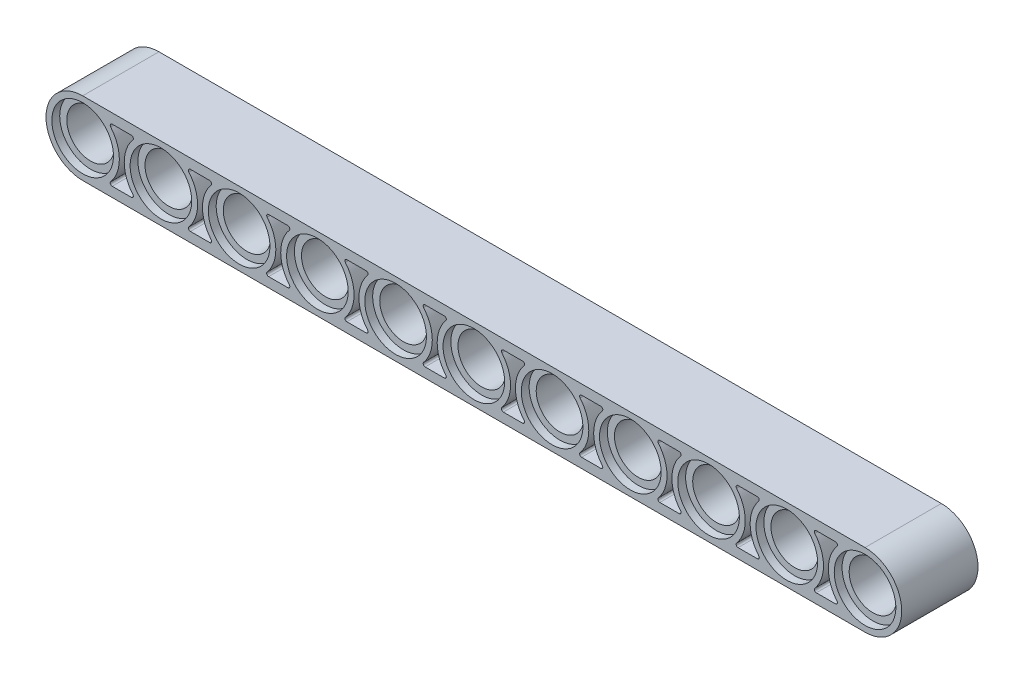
from build123d import *

# Parameters (mm, degrees)
BODY_DEPTH                   = 3.9
CUT_OUT_DEPTH                = 3.4
HOLE_PATTERN_COUNT           = 11
HOLE_PATTERN_PITCH           = 8
CUT_OUT_PATTERN_COUNT        = 10
CUT_OUT_PATTERN_PITCH        = 8
CUT_OUT_PATTERN_COPY_1_DEPTH = 3.4
CUT_OUT_PATTERN_COPY_2_DEPTH = 3.4
CUT_OUT_PATTERN_COPY_3_DEPTH = 3.4
CUT_OUT_PATTERN_COPY_4_DEPTH = 3.4
CUT_OUT_PATTERN_COPY_5_DEPTH = 3.4
CUT_OUT_PATTERN_COPY_6_DEPTH = 3.4
CUT_OUT_PATTERN_COPY_7_DEPTH = 3.4
CUT_OUT_PATTERN_COPY_8_DEPTH = 3.4
CUT_OUT_PATTERN_COPY_9_DEPTH = 3.4


with BuildPart() as part:
    # Sketch1 → Body (new, symmetric)
    with BuildSketch(Plane.XY):
        with BuildLine():
            Line((0, 3.75), (80, 3.75))
            ThreePointArc((80, 3.75), (83.75, 0), (80, -3.75))
            Line((80, -3.75), (0, -3.75))
            ThreePointArc((0, -3.75), (-3.75, 0), (0, 3.75))
        make_face()
    extrude(amount=BODY_DEPTH, both=True)

    # Sketch2 → Hole (revolve, cut)
    with BuildSketch(Plane(origin=(0, 0, 0), x_dir=(1, 0, 0), z_dir=(0, 1, 0)), mode=Mode.PRIVATE) as hole_sk:
        Polygon((0, -3.9), (0, 3.9), (3.15, 3.9), (3.15, 3.1), (2.425, 3.1), (2.425, -3.1), (3.15, -3.1), (3.15, -3.9), align=None)
    hole = revolve(hole_sk.sketch.rotate(Axis((0, 0, -4.29), (0, 0, 1)), 180), axis=Axis((0, 0, -4.29), (0, 0, 1)), mode=Mode.SUBTRACT)

    # Sketch3 → Cut Out (cut)
    with BuildSketch(Plane.XY.offset(3.9)):
        with BuildLine():
            Line((3.016620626, 2.75), (4.983379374, 2.75))
            ThreePointArc((4.983379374, 2.75), (5.164794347, 2.634193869), (5.136119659, 2.420886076))
            ThreePointArc((5.136119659, 2.420886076), (4.25, 0), (5.136119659, -2.420886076))
            ThreePointArc((5.136119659, -2.420886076), (5.164794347, -2.634193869), (4.983379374, -2.75))
            Line((4.983379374, -2.75), (3.016620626, -2.75))
            ThreePointArc((3.016620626, -2.75), (2.835205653, -2.634193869), (2.863880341, -2.420886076))
            ThreePointArc((2.863880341, -2.420886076), (3.75, 0), (2.863880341, 2.420886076))
            ThreePointArc((2.863880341, 2.420886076), (2.835205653, 2.634193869), (3.016620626, 2.75))
        make_face()
    cut_out = extrude(amount=-CUT_OUT_DEPTH, mode=Mode.SUBTRACT)

    # Mirror1: Cut Out across plane
    add(cut_out.mirror(Plane.XY), mode=Mode.SUBTRACT)

    # HOLE Pattern: Hole ×11
    with Locations(*[(i * HOLE_PATTERN_PITCH, 0, 0) for i in range(1, HOLE_PATTERN_COUNT)]):
        add(hole, mode=Mode.SUBTRACT)

    # CUT OUT Pattern: Cut Out ×10
    with Locations(*[(i * CUT_OUT_PATTERN_PITCH, 0, 0) for i in range(1, CUT_OUT_PATTERN_COUNT)]):
        add(cut_out, mode=Mode.SUBTRACT)

    # CUT OUT Pattern copy 1 sketch → CUT OUT Pattern copy 1 (cut)
    with BuildSketch(Plane(origin=(8, 0, -3.9), x_dir=(1, 0, 0), z_dir=(0, 0, -1))):
        with BuildLine():
            Line((3.016620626, -2.75), (4.983379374, -2.75))
            ThreePointArc((4.983379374, -2.75), (5.164794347, -2.634193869), (5.136119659, -2.420886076))
            ThreePointArc((5.136119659, -2.420886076), (4.25, 0), (5.136119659, 2.420886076))
            ThreePointArc((5.136119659, 2.420886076), (5.164794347, 2.634193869), (4.983379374, 2.75))
            Line((4.983379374, 2.75), (3.016620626, 2.75))
            ThreePointArc((3.016620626, 2.75), (2.835205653, 2.634193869), (2.863880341, 2.420886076))
            ThreePointArc((2.863880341, 2.420886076), (3.75, 0), (2.863880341, -2.420886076))
            ThreePointArc((2.863880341, -2.420886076), (2.835205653, -2.634193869), (3.016620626, -2.75))
        make_face()
    extrude(amount=-CUT_OUT_PATTERN_COPY_1_DEPTH, mode=Mode.SUBTRACT)

    # CUT OUT Pattern copy 2 sketch → CUT OUT Pattern copy 2 (cut)
    with BuildSketch(Plane(origin=(16, 0, -3.9), x_dir=(1, 0, 0), z_dir=(0, 0, -1))):
        with BuildLine():
            Line((3.016620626, -2.75), (4.983379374, -2.75))
            ThreePointArc((4.983379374, -2.75), (5.164794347, -2.634193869), (5.136119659, -2.420886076))
            ThreePointArc((5.136119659, -2.420886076), (4.25, 0), (5.136119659, 2.420886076))
            ThreePointArc((5.136119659, 2.420886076), (5.164794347, 2.634193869), (4.983379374, 2.75))
            Line((4.983379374, 2.75), (3.016620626, 2.75))
            ThreePointArc((3.016620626, 2.75), (2.835205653, 2.634193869), (2.863880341, 2.420886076))
            ThreePointArc((2.863880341, 2.420886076), (3.75, 0), (2.863880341, -2.420886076))
            ThreePointArc((2.863880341, -2.420886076), (2.835205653, -2.634193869), (3.016620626, -2.75))
        make_face()
    extrude(amount=-CUT_OUT_PATTERN_COPY_2_DEPTH, mode=Mode.SUBTRACT)

    # CUT OUT Pattern copy 3 sketch → CUT OUT Pattern copy 3 (cut)
    with BuildSketch(Plane(origin=(24, 0, -3.9), x_dir=(1, 0, 0), z_dir=(0, 0, -1))):
        with BuildLine():
            Line((3.016620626, -2.75), (4.983379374, -2.75))
            ThreePointArc((4.983379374, -2.75), (5.164794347, -2.634193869), (5.136119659, -2.420886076))
            ThreePointArc((5.136119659, -2.420886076), (4.25, 0), (5.136119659, 2.420886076))
            ThreePointArc((5.136119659, 2.420886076), (5.164794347, 2.634193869), (4.983379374, 2.75))
            Line((4.983379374, 2.75), (3.016620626, 2.75))
            ThreePointArc((3.016620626, 2.75), (2.835205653, 2.634193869), (2.863880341, 2.420886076))
            ThreePointArc((2.863880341, 2.420886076), (3.75, 0), (2.863880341, -2.420886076))
            ThreePointArc((2.863880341, -2.420886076), (2.835205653, -2.634193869), (3.016620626, -2.75))
        make_face()
    extrude(amount=-CUT_OUT_PATTERN_COPY_3_DEPTH, mode=Mode.SUBTRACT)

    # CUT OUT Pattern copy 4 sketch → CUT OUT Pattern copy 4 (cut)
    with BuildSketch(Plane(origin=(32, 0, -3.9), x_dir=(1, 0, 0), z_dir=(0, 0, -1))):
        with BuildLine():
            Line((3.016620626, -2.75), (4.983379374, -2.75))
            ThreePointArc((4.983379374, -2.75), (5.164794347, -2.634193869), (5.136119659, -2.420886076))
            ThreePointArc((5.136119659, -2.420886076), (4.25, 0), (5.136119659, 2.420886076))
            ThreePointArc((5.136119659, 2.420886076), (5.164794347, 2.634193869), (4.983379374, 2.75))
            Line((4.983379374, 2.75), (3.016620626, 2.75))
            ThreePointArc((3.016620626, 2.75), (2.835205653, 2.634193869), (2.863880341, 2.420886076))
            ThreePointArc((2.863880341, 2.420886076), (3.75, 0), (2.863880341, -2.420886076))
            ThreePointArc((2.863880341, -2.420886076), (2.835205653, -2.634193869), (3.016620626, -2.75))
        make_face()
    extrude(amount=-CUT_OUT_PATTERN_COPY_4_DEPTH, mode=Mode.SUBTRACT)

    # CUT OUT Pattern copy 5 sketch → CUT OUT Pattern copy 5 (cut)
    with BuildSketch(Plane(origin=(40, 0, -3.9), x_dir=(1, 0, 0), z_dir=(0, 0, -1))):
        with BuildLine():
            Line((3.016620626, -2.75), (4.983379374, -2.75))
            ThreePointArc((4.983379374, -2.75), (5.164794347, -2.634193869), (5.136119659, -2.420886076))
            ThreePointArc((5.136119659, -2.420886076), (4.25, 0), (5.136119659, 2.420886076))
            ThreePointArc((5.136119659, 2.420886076), (5.164794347, 2.634193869), (4.983379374, 2.75))
            Line((4.983379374, 2.75), (3.016620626, 2.75))
            ThreePointArc((3.016620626, 2.75), (2.835205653, 2.634193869), (2.863880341, 2.420886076))
            ThreePointArc((2.863880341, 2.420886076), (3.75, 0), (2.863880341, -2.420886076))
            ThreePointArc((2.863880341, -2.420886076), (2.835205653, -2.634193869), (3.016620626, -2.75))
        make_face()
    extrude(amount=-CUT_OUT_PATTERN_COPY_5_DEPTH, mode=Mode.SUBTRACT)

    # CUT OUT Pattern copy 6 sketch → CUT OUT Pattern copy 6 (cut)
    with BuildSketch(Plane(origin=(48, 0, -3.9), x_dir=(1, 0, 0), z_dir=(0, 0, -1))):
        with BuildLine():
            Line((3.016620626, -2.75), (4.983379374, -2.75))
            ThreePointArc((4.983379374, -2.75), (5.164794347, -2.634193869), (5.136119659, -2.420886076))
            ThreePointArc((5.136119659, -2.420886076), (4.25, 0), (5.136119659, 2.420886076))
            ThreePointArc((5.136119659, 2.420886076), (5.164794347, 2.634193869), (4.983379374, 2.75))
            Line((4.983379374, 2.75), (3.016620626, 2.75))
            ThreePointArc((3.016620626, 2.75), (2.835205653, 2.634193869), (2.863880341, 2.420886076))
            ThreePointArc((2.863880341, 2.420886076), (3.75, 0), (2.863880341, -2.420886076))
            ThreePointArc((2.863880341, -2.420886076), (2.835205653, -2.634193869), (3.016620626, -2.75))
        make_face()
    extrude(amount=-CUT_OUT_PATTERN_COPY_6_DEPTH, mode=Mode.SUBTRACT)

    # CUT OUT Pattern copy 7 sketch → CUT OUT Pattern copy 7 (cut)
    with BuildSketch(Plane(origin=(56, 0, -3.9), x_dir=(1, 0, 0), z_dir=(0, 0, -1))):
        with BuildLine():
            Line((3.016620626, -2.75), (4.983379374, -2.75))
            ThreePointArc((4.983379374, -2.75), (5.164794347, -2.634193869), (5.136119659, -2.420886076))
            ThreePointArc((5.136119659, -2.420886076), (4.25, 0), (5.136119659, 2.420886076))
            ThreePointArc((5.136119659, 2.420886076), (5.164794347, 2.634193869), (4.983379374, 2.75))
            Line((4.983379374, 2.75), (3.016620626, 2.75))
            ThreePointArc((3.016620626, 2.75), (2.835205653, 2.634193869), (2.863880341, 2.420886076))
            ThreePointArc((2.863880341, 2.420886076), (3.75, 0), (2.863880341, -2.420886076))
            ThreePointArc((2.863880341, -2.420886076), (2.835205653, -2.634193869), (3.016620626, -2.75))
        make_face()
    extrude(amount=-CUT_OUT_PATTERN_COPY_7_DEPTH, mode=Mode.SUBTRACT)

    # CUT OUT Pattern copy 8 sketch → CUT OUT Pattern copy 8 (cut)
    with BuildSketch(Plane(origin=(64, 0, -3.9), x_dir=(1, 0, 0), z_dir=(0, 0, -1))):
        with BuildLine():
            Line((3.016620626, -2.75), (4.983379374, -2.75))
            ThreePointArc((4.983379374, -2.75), (5.164794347, -2.634193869), (5.136119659, -2.420886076))
            ThreePointArc((5.136119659, -2.420886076), (4.25, 0), (5.136119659, 2.420886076))
            ThreePointArc((5.136119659, 2.420886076), (5.164794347, 2.634193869), (4.983379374, 2.75))
            Line((4.983379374, 2.75), (3.016620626, 2.75))
            ThreePointArc((3.016620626, 2.75), (2.835205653, 2.634193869), (2.863880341, 2.420886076))
            ThreePointArc((2.863880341, 2.420886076), (3.75, 0), (2.863880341, -2.420886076))
            ThreePointArc((2.863880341, -2.420886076), (2.835205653, -2.634193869), (3.016620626, -2.75))
        make_face()
    extrude(amount=-CUT_OUT_PATTERN_COPY_8_DEPTH, mode=Mode.SUBTRACT)

    # CUT OUT Pattern copy 9 sketch → CUT OUT Pattern copy 9 (cut)
    with BuildSketch(Plane(origin=(72, 0, -3.9), x_dir=(1, 0, 0), z_dir=(0, 0, -1))):
        with BuildLine():
            Line((3.016620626, -2.75), (4.983379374, -2.75))
            ThreePointArc((4.983379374, -2.75), (5.164794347, -2.634193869), (5.136119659, -2.420886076))
            ThreePointArc((5.136119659, -2.420886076), (4.25, 0), (5.136119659, 2.420886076))
            ThreePointArc((5.136119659, 2.420886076), (5.164794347, 2.634193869), (4.983379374, 2.75))
            Line((4.983379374, 2.75), (3.016620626, 2.75))
            ThreePointArc((3.016620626, 2.75), (2.835205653, 2.634193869), (2.863880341, 2.420886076))
            ThreePointArc((2.863880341, 2.420886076), (3.75, 0), (2.863880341, -2.420886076))
            ThreePointArc((2.863880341, -2.420886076), (2.835205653, -2.634193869), (3.016620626, -2.75))
        make_face()
    extrude(amount=-CUT_OUT_PATTERN_COPY_9_DEPTH, mode=Mode.SUBTRACT)


solid = part.part
